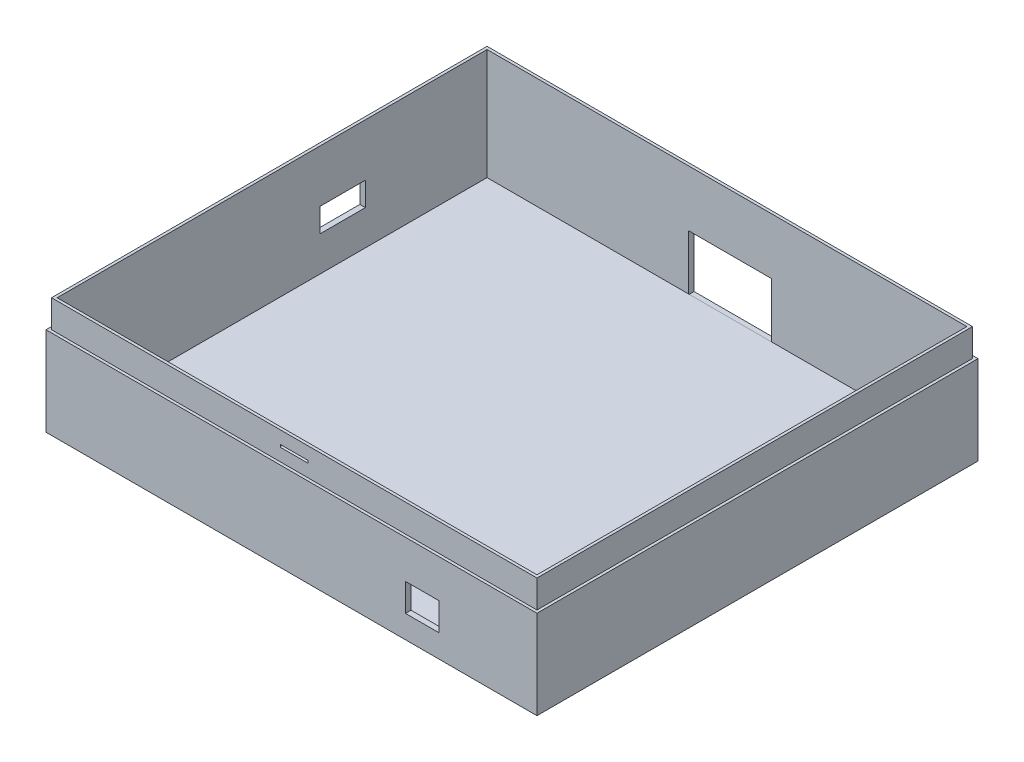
ISO-10303-21;
HEADER;
FILE_DESCRIPTION(('STEP AP214'),'2;1');
FILE_NAME('part.step','',(''),(''),'','','');
FILE_SCHEMA(('AUTOMOTIVE_DESIGN { 1 0 10303 214 1 1 1 1 }'));
ENDSEC;
DATA;
#1=APPLICATION_CONTEXT('core data for automotive mechanical design processes');
#2=APPLICATION_PROTOCOL_DEFINITION('international standard','automotive_design',2000,#1);
#3=PRODUCT_CONTEXT('',#1,'mechanical');
#4=PRODUCT('Part','Part','',(#3));
#5=PRODUCT_RELATED_PRODUCT_CATEGORY('part','',(#4));
#6=PRODUCT_DEFINITION_FORMATION('','',#4);
#7=PRODUCT_DEFINITION_CONTEXT('part definition',#1,'design');
#8=PRODUCT_DEFINITION('design','',#6,#7);
#9=PRODUCT_DEFINITION_SHAPE('','',#8);
#10=(LENGTH_UNIT() NAMED_UNIT(*) SI_UNIT(.MILLI.,.METRE.));
#11=(NAMED_UNIT(*) PLANE_ANGLE_UNIT() SI_UNIT($,.RADIAN.));
#12=(NAMED_UNIT(*) SI_UNIT($,.STERADIAN.) SOLID_ANGLE_UNIT());
#13=UNCERTAINTY_MEASURE_WITH_UNIT(LENGTH_MEASURE(1.E-05),#10,'distance_accuracy_value','');
#14=(GEOMETRIC_REPRESENTATION_CONTEXT(3) GLOBAL_UNCERTAINTY_ASSIGNED_CONTEXT((#13)) GLOBAL_UNIT_ASSIGNED_CONTEXT((#10,
#11,#12)) REPRESENTATION_CONTEXT('',''));
#15=CARTESIAN_POINT('',(0.,0.,0.));
#16=DIRECTION('',(0.,0.,1.));
#17=DIRECTION('',(1.,0.,0.));
#18=AXIS2_PLACEMENT_3D('',#15,#16,#17);
#19=CARTESIAN_POINT('',(0.,32.,0.999999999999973));
#20=DIRECTION('',(0.,0.,1.));
#21=DIRECTION('',(1.,0.,0.));
#22=AXIS2_PLACEMENT_3D('',#19,#20,#21);
#23=PLANE('',#22);
#24=DIRECTION('',(1.,0.,0.));
#25=VECTOR('',#24,1.);
#26=CARTESIAN_POINT('',(0.,42.,0.999999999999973));
#27=LINE('',#26,#25);
#28=CARTESIAN_POINT('',(-0.999999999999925,42.,0.999999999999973));
#29=VERTEX_POINT('',#28);
#30=CARTESIAN_POINT('',(174.,42.,0.999999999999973));
#31=VERTEX_POINT('',#30);
#32=EDGE_CURVE('E348',#29,#31,#27,.T.);
#33=ORIENTED_EDGE('',*,*,#32,.F.);
#34=DIRECTION('',(0.,1.,0.));
#35=VECTOR('',#34,1.);
#36=CARTESIAN_POINT('',(-0.999999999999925,32.,0.999999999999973));
#37=LINE('',#36,#35);
#38=CARTESIAN_POINT('',(-0.999999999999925,32.,0.999999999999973));
#39=VERTEX_POINT('',#38);
#40=EDGE_CURVE('E368',#39,#29,#37,.T.);
#41=ORIENTED_EDGE('',*,*,#40,.F.);
#42=DIRECTION('',(1.,0.,0.));
#43=VECTOR('',#42,1.);
#44=CARTESIAN_POINT('',(0.,32.,0.999999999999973));
#45=LINE('',#44,#43);
#46=CARTESIAN_POINT('',(174.,32.,0.999999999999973));
#47=VERTEX_POINT('',#46);
#48=EDGE_CURVE('E349',#39,#47,#45,.T.);
#49=ORIENTED_EDGE('',*,*,#48,.T.);
#50=DIRECTION('',(0.,1.,0.));
#51=VECTOR('',#50,1.);
#52=CARTESIAN_POINT('',(174.,32.,0.999999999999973));
#53=LINE('',#52,#51);
#54=EDGE_CURVE('E379',#47,#31,#53,.T.);
#55=ORIENTED_EDGE('',*,*,#54,.T.);
#56=EDGE_LOOP('',(#33,#41,#49,#55));
#57=FACE_BOUND('',#56,.T.);
#58=DIRECTION('',(1.,0.,0.));
#59=VECTOR('',#58,1.);
#60=CARTESIAN_POINT('',(81.5,36.56,1.));
#61=LINE('',#60,#59);
#62=CARTESIAN_POINT('',(81.5,36.56,1.));
#63=VERTEX_POINT('',#62);
#64=CARTESIAN_POINT('',(91.5,36.56,0.999999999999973));
#65=VERTEX_POINT('',#64);
#66=EDGE_CURVE('E322',#63,#65,#61,.T.);
#67=ORIENTED_EDGE('',*,*,#66,.F.);
#68=DIRECTION('',(0.,-1.,0.));
#69=VECTOR('',#68,1.);
#70=CARTESIAN_POINT('',(81.5,37.,1.));
#71=LINE('',#70,#69);
#72=CARTESIAN_POINT('',(81.5,37.44,1.00000000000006));
#73=VERTEX_POINT('',#72);
#74=EDGE_CURVE('E311',#73,#63,#71,.T.);
#75=ORIENTED_EDGE('',*,*,#74,.F.);
#76=DIRECTION('',(1.,0.,0.));
#77=VECTOR('',#76,1.);
#78=CARTESIAN_POINT('',(81.5,37.44,1.00000000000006));
#79=LINE('',#78,#77);
#80=CARTESIAN_POINT('',(91.5,37.44,1.00000000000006));
#81=VERTEX_POINT('',#80);
#82=EDGE_CURVE('E319',#73,#81,#79,.T.);
#83=ORIENTED_EDGE('',*,*,#82,.T.);
#84=DIRECTION('',(0.,-1.,0.));
#85=VECTOR('',#84,1.);
#86=CARTESIAN_POINT('',(91.5,37.,1.));
#87=LINE('',#86,#85);
#88=EDGE_CURVE('E302',#81,#65,#87,.T.);
#89=ORIENTED_EDGE('',*,*,#88,.T.);
#90=EDGE_LOOP('',(#67,#75,#83,#89));
#91=FACE_BOUND('',#90,.T.);
#92=ADVANCED_FACE('F43',(#57,#91),#23,.T.);
#93=CARTESIAN_POINT('',(0.,32.,-156.));
#94=DIRECTION('',(0.,0.,1.));
#95=DIRECTION('',(1.,0.,0.));
#96=AXIS2_PLACEMENT_3D('',#93,#94,#95);
#97=PLANE('',#96);
#98=DIRECTION('',(1.,0.,0.));
#99=VECTOR('',#98,1.);
#100=CARTESIAN_POINT('',(0.,42.,-156.));
#101=LINE('',#100,#99);
#102=CARTESIAN_POINT('',(-0.999999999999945,42.,-156.));
#103=VERTEX_POINT('',#102);
#104=CARTESIAN_POINT('',(174.,42.,-156.));
#105=VERTEX_POINT('',#104);
#106=EDGE_CURVE('E374',#103,#105,#101,.T.);
#107=ORIENTED_EDGE('',*,*,#106,.T.);
#108=DIRECTION('',(0.,1.,0.));
#109=VECTOR('',#108,1.);
#110=CARTESIAN_POINT('',(174.,32.,-156.));
#111=LINE('',#110,#109);
#112=CARTESIAN_POINT('',(174.,32.,-156.));
#113=VERTEX_POINT('',#112);
#114=EDGE_CURVE('E382',#113,#105,#111,.T.);
#115=ORIENTED_EDGE('',*,*,#114,.F.);
#116=DIRECTION('',(1.,0.,0.));
#117=VECTOR('',#116,1.);
#118=CARTESIAN_POINT('',(0.,32.,-156.));
#119=LINE('',#118,#117);
#120=CARTESIAN_POINT('',(-0.999999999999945,32.,-156.));
#121=VERTEX_POINT('',#120);
#122=EDGE_CURVE('E354',#121,#113,#119,.T.);
#123=ORIENTED_EDGE('',*,*,#122,.F.);
#124=DIRECTION('',(0.,1.,0.));
#125=VECTOR('',#124,1.);
#126=CARTESIAN_POINT('',(-0.999999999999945,32.,-156.));
#127=LINE('',#126,#125);
#128=EDGE_CURVE('E384',#121,#103,#127,.T.);
#129=ORIENTED_EDGE('',*,*,#128,.T.);
#130=EDGE_LOOP('',(#107,#115,#123,#129));
#131=FACE_BOUND('',#130,.T.);
#132=DIRECTION('',(0.,-1.,1.26161707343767E-13));
#133=VECTOR('',#132,1.);
#134=CARTESIAN_POINT('',(81.5,37.,-156.));
#135=LINE('',#134,#133);
#136=CARTESIAN_POINT('',(81.5,37.44,-156.));
#137=VERTEX_POINT('',#136);
#138=CARTESIAN_POINT('',(81.5,36.56,-156.));
#139=VERTEX_POINT('',#138);
#140=EDGE_CURVE('E337',#137,#139,#135,.T.);
#141=ORIENTED_EDGE('',*,*,#140,.T.);
#142=DIRECTION('',(1.,0.,0.));
#143=VECTOR('',#142,1.);
#144=CARTESIAN_POINT('',(81.5,36.56,-156.));
#145=LINE('',#144,#143);
#146=CARTESIAN_POINT('',(91.5,36.56,-156.));
#147=VERTEX_POINT('',#146);
#148=EDGE_CURVE('E340',#139,#147,#145,.T.);
#149=ORIENTED_EDGE('',*,*,#148,.T.);
#150=DIRECTION('',(0.,-1.,1.26161707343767E-13));
#151=VECTOR('',#150,1.);
#152=CARTESIAN_POINT('',(91.5,37.,-156.));
#153=LINE('',#152,#151);
#154=CARTESIAN_POINT('',(91.5,37.44,-156.));
#155=VERTEX_POINT('',#154);
#156=EDGE_CURVE('E330',#155,#147,#153,.T.);
#157=ORIENTED_EDGE('',*,*,#156,.F.);
#158=DIRECTION('',(1.,0.,0.));
#159=VECTOR('',#158,1.);
#160=CARTESIAN_POINT('',(81.5,37.44,-156.));
#161=LINE('',#160,#159);
#162=EDGE_CURVE('E343',#137,#155,#161,.T.);
#163=ORIENTED_EDGE('',*,*,#162,.F.);
#164=EDGE_LOOP('',(#141,#149,#157,#163));
#165=FACE_BOUND('',#164,.T.);
#166=ADVANCED_FACE('F514',(#131,#165),#97,.F.);
#167=CARTESIAN_POINT('',(-1.99999999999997,1.99999999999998,1.99999999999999));
#168=DIRECTION('',(-1.,0.,0.));
#169=DIRECTION('',(0.,0.,1.));
#170=AXIS2_PLACEMENT_3D('',#167,#168,#169);
#171=PLANE('',#170);
#172=DIRECTION('',(0.,0.,1.));
#173=VECTOR('',#172,1.);
#174=CARTESIAN_POINT('',(-1.99999999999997,14.5592636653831,0.));
#175=LINE('',#174,#173);
#176=CARTESIAN_POINT('',(-1.99999999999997,14.5592636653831,-111.153651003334));
#177=VERTEX_POINT('',#176);
#178=CARTESIAN_POINT('',(-1.99999999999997,14.5592636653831,-94.8536510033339));
#179=VERTEX_POINT('',#178);
#180=EDGE_CURVE('E58',#177,#179,#175,.T.);
#181=ORIENTED_EDGE('',*,*,#180,.F.);
#182=DIRECTION('',(0.,1.,0.));
#183=VECTOR('',#182,1.);
#184=CARTESIAN_POINT('',(-1.99999999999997,0.,-111.153651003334));
#185=LINE('',#184,#183);
#186=CARTESIAN_POINT('',(-1.99999999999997,23.1276174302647,-111.153651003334));
#187=VERTEX_POINT('',#186);
#188=EDGE_CURVE('E261',#177,#187,#185,.T.);
#189=ORIENTED_EDGE('',*,*,#188,.T.);
#190=DIRECTION('',(0.,0.,1.));
#191=VECTOR('',#190,1.);
#192=CARTESIAN_POINT('',(-1.99999999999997,23.1276174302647,0.));
#193=LINE('',#192,#191);
#194=CARTESIAN_POINT('',(-1.99999999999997,23.1276174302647,-94.8536510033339));
#195=VERTEX_POINT('',#194);
#196=EDGE_CURVE('E264',#187,#195,#193,.T.);
#197=ORIENTED_EDGE('',*,*,#196,.T.);
#198=DIRECTION('',(0.,1.,0.));
#199=VECTOR('',#198,1.);
#200=CARTESIAN_POINT('',(-1.99999999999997,0.,-94.8536510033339));
#201=LINE('',#200,#199);
#202=EDGE_CURVE('E270',#179,#195,#201,.T.);
#203=ORIENTED_EDGE('',*,*,#202,.F.);
#204=EDGE_LOOP('',(#181,#189,#197,#203));
#205=FACE_BOUND('',#204,.T.);
#206=DIRECTION('',(0.,-1.,0.));
#207=VECTOR('',#206,1.);
#208=CARTESIAN_POINT('',(-1.99999999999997,1.99999999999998,1.99999999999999));
#209=LINE('',#208,#207);
#210=CARTESIAN_POINT('',(-1.99999999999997,32.,1.99999999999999));
#211=VERTEX_POINT('',#210);
#212=CARTESIAN_POINT('',(-1.99999999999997,0.,1.99999999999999));
#213=VERTEX_POINT('',#212);
#214=EDGE_CURVE('E464',#211,#213,#209,.T.);
#215=ORIENTED_EDGE('',*,*,#214,.F.);
#216=DIRECTION('',(0.,0.,1.));
#217=VECTOR('',#216,1.);
#218=CARTESIAN_POINT('',(-1.99999999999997,32.,0.));
#219=LINE('',#218,#217);
#220=CARTESIAN_POINT('',(-1.99999999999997,32.,-157.));
#221=VERTEX_POINT('',#220);
#222=EDGE_CURVE('E366',#221,#211,#219,.T.);
#223=ORIENTED_EDGE('',*,*,#222,.F.);
#224=DIRECTION('',(0.,-1.,0.));
#225=VECTOR('',#224,1.);
#226=CARTESIAN_POINT('',(-1.99999999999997,1.99999999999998,-157.));
#227=LINE('',#226,#225);
#228=CARTESIAN_POINT('',(-1.99999999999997,0.,-157.));
#229=VERTEX_POINT('',#228);
#230=EDGE_CURVE('E463',#221,#229,#227,.T.);
#231=ORIENTED_EDGE('',*,*,#230,.T.);
#232=DIRECTION('',(0.,0.,-1.));
#233=VECTOR('',#232,1.);
#234=CARTESIAN_POINT('',(-1.99999999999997,0.,1.99999999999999));
#235=LINE('',#234,#233);
#236=EDGE_CURVE('E451',#213,#229,#235,.T.);
#237=ORIENTED_EDGE('',*,*,#236,.F.);
#238=EDGE_LOOP('',(#215,#223,#231,#237));
#239=FACE_BOUND('',#238,.T.);
#240=ADVANCED_FACE('F522',(#205,#239),#171,.T.);
#241=CARTESIAN_POINT('',(-1.99999999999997,1.99999999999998,1.99999999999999));
#242=DIRECTION('',(0.,0.,1.));
#243=DIRECTION('',(1.,0.,0.));
#244=AXIS2_PLACEMENT_3D('',#241,#242,#243);
#245=PLANE('',#244);
#246=DIRECTION('',(1.,0.,0.));
#247=VECTOR('',#246,1.);
#248=CARTESIAN_POINT('',(0.,8.2402439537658,1.99999999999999));
#249=LINE('',#248,#247);
#250=CARTESIAN_POINT('',(127.606016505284,8.2402439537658,1.99999999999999));
#251=VERTEX_POINT('',#250);
#252=CARTESIAN_POINT('',(139.606016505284,8.2402439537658,1.99999999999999));
#253=VERTEX_POINT('',#252);
#254=EDGE_CURVE('E276',#251,#253,#249,.T.);
#255=ORIENTED_EDGE('',*,*,#254,.F.);
#256=DIRECTION('',(0.,1.,0.));
#257=VECTOR('',#256,1.);
#258=CARTESIAN_POINT('',(127.606016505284,0.,1.99999999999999));
#259=LINE('',#258,#257);
#260=CARTESIAN_POINT('',(127.606016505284,18.2402439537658,1.99999999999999));
#261=VERTEX_POINT('',#260);
#262=EDGE_CURVE('E287',#251,#261,#259,.T.);
#263=ORIENTED_EDGE('',*,*,#262,.T.);
#264=DIRECTION('',(1.,0.,0.));
#265=VECTOR('',#264,1.);
#266=CARTESIAN_POINT('',(0.,18.2402439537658,1.99999999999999));
#267=LINE('',#266,#265);
#268=CARTESIAN_POINT('',(139.606016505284,18.2402439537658,1.99999999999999));
#269=VERTEX_POINT('',#268);
#270=EDGE_CURVE('E284',#261,#269,#267,.T.);
#271=ORIENTED_EDGE('',*,*,#270,.T.);
#272=DIRECTION('',(0.,1.,0.));
#273=VECTOR('',#272,1.);
#274=CARTESIAN_POINT('',(139.606016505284,0.,1.99999999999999));
#275=LINE('',#274,#273);
#276=EDGE_CURVE('E281',#253,#269,#275,.T.);
#277=ORIENTED_EDGE('',*,*,#276,.F.);
#278=EDGE_LOOP('',(#255,#263,#271,#277));
#279=FACE_BOUND('',#278,.T.);
#280=DIRECTION('',(0.,-1.,0.));
#281=VECTOR('',#280,1.);
#282=CARTESIAN_POINT('',(175.,1.99999999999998,1.99999999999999));
#283=LINE('',#282,#281);
#284=CARTESIAN_POINT('',(175.,32.,1.99999999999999));
#285=VERTEX_POINT('',#284);
#286=CARTESIAN_POINT('',(175.,0.,1.99999999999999));
#287=VERTEX_POINT('',#286);
#288=EDGE_CURVE('E467',#285,#287,#283,.T.);
#289=ORIENTED_EDGE('',*,*,#288,.F.);
#290=DIRECTION('',(1.,0.,0.));
#291=VECTOR('',#290,1.);
#292=CARTESIAN_POINT('',(0.,32.,1.99999999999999));
#293=LINE('',#292,#291);
#294=EDGE_CURVE('E360',#211,#285,#293,.T.);
#295=ORIENTED_EDGE('',*,*,#294,.F.);
#296=ORIENTED_EDGE('',*,*,#214,.T.);
#297=DIRECTION('',(-1.,0.,0.));
#298=VECTOR('',#297,1.);
#299=CARTESIAN_POINT('',(-1.99999999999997,0.,1.99999999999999));
#300=LINE('',#299,#298);
#301=EDGE_CURVE('E460',#287,#213,#300,.T.);
#302=ORIENTED_EDGE('',*,*,#301,.F.);
#303=EDGE_LOOP('',(#289,#295,#296,#302));
#304=FACE_BOUND('',#303,.T.);
#305=ADVANCED_FACE('F495',(#279,#304),#245,.T.);
#306=CARTESIAN_POINT('',(175.,1.99999999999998,1.99999999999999));
#307=DIRECTION('',(1.,0.,0.));
#308=DIRECTION('',(0.,0.,-1.));
#309=AXIS2_PLACEMENT_3D('',#306,#307,#308);
#310=PLANE('',#309);
#311=DIRECTION('',(0.,-1.,0.));
#312=VECTOR('',#311,1.);
#313=CARTESIAN_POINT('',(175.,1.99999999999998,-157.));
#314=LINE('',#313,#312);
#315=CARTESIAN_POINT('',(175.,32.,-157.));
#316=VERTEX_POINT('',#315);
#317=CARTESIAN_POINT('',(175.,0.,-157.));
#318=VERTEX_POINT('',#317);
#319=EDGE_CURVE('E469',#316,#318,#314,.T.);
#320=ORIENTED_EDGE('',*,*,#319,.F.);
#321=DIRECTION('',(0.,0.,-1.));
#322=VECTOR('',#321,1.);
#323=CARTESIAN_POINT('',(175.,32.,0.));
#324=LINE('',#323,#322);
#325=EDGE_CURVE('E362',#285,#316,#324,.T.);
#326=ORIENTED_EDGE('',*,*,#325,.F.);
#327=ORIENTED_EDGE('',*,*,#288,.T.);
#328=DIRECTION('',(0.,0.,1.));
#329=VECTOR('',#328,1.);
#330=CARTESIAN_POINT('',(175.,0.,1.99999999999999));
#331=LINE('',#330,#329);
#332=EDGE_CURVE('E457',#318,#287,#331,.T.);
#333=ORIENTED_EDGE('',*,*,#332,.F.);
#334=EDGE_LOOP('',(#320,#326,#327,#333));
#335=FACE_BOUND('',#334,.T.);
#336=ADVANCED_FACE('F570',(#335),#310,.T.);
#337=CARTESIAN_POINT('',(-1.99999999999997,1.99999999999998,-157.));
#338=DIRECTION('',(0.,0.,-1.));
#339=DIRECTION('',(-1.,0.,0.));
#340=AXIS2_PLACEMENT_3D('',#337,#338,#339);
#341=PLANE('',#340);
#342=DIRECTION('',(0.,1.,0.));
#343=VECTOR('',#342,1.);
#344=CARTESIAN_POINT('',(72.6351643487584,1.99999999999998,-157.));
#345=LINE('',#344,#343);
#346=CARTESIAN_POINT('',(72.6351643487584,1.75540363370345,-157.));
#347=VERTEX_POINT('',#346);
#348=CARTESIAN_POINT('',(72.6351643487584,21.7554036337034,-157.));
#349=VERTEX_POINT('',#348);
#350=EDGE_CURVE('E413',#347,#349,#345,.T.);
#351=ORIENTED_EDGE('',*,*,#350,.F.);
#352=DIRECTION('',(-1.,0.,0.));
#353=VECTOR('',#352,1.);
#354=CARTESIAN_POINT('',(-1.99999999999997,1.75540363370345,-157.));
#355=LINE('',#354,#353);
#356=CARTESIAN_POINT('',(102.635164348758,1.75540363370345,-157.));
#357=VERTEX_POINT('',#356);
#358=EDGE_CURVE('E466',#357,#347,#355,.T.);
#359=ORIENTED_EDGE('',*,*,#358,.F.);
#360=DIRECTION('',(0.,-1.,0.));
#361=VECTOR('',#360,1.);
#362=CARTESIAN_POINT('',(102.635164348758,1.99999999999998,-157.));
#363=LINE('',#362,#361);
#364=CARTESIAN_POINT('',(102.635164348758,21.7554036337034,-157.));
#365=VERTEX_POINT('',#364);
#366=EDGE_CURVE('E403',#365,#357,#363,.T.);
#367=ORIENTED_EDGE('',*,*,#366,.F.);
#368=DIRECTION('',(1.,0.,0.));
#369=VECTOR('',#368,1.);
#370=CARTESIAN_POINT('',(-1.99999999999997,21.7554036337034,-157.));
#371=LINE('',#370,#369);
#372=EDGE_CURVE('E411',#349,#365,#371,.T.);
#373=ORIENTED_EDGE('',*,*,#372,.F.);
#374=EDGE_LOOP('',(#351,#359,#367,#373));
#375=FACE_BOUND('',#374,.T.);
#376=ORIENTED_EDGE('',*,*,#230,.F.);
#377=DIRECTION('',(-1.,0.,0.));
#378=VECTOR('',#377,1.);
#379=CARTESIAN_POINT('',(0.,32.,-157.));
#380=LINE('',#379,#378);
#381=EDGE_CURVE('E364',#316,#221,#380,.T.);
#382=ORIENTED_EDGE('',*,*,#381,.F.);
#383=ORIENTED_EDGE('',*,*,#319,.T.);
#384=DIRECTION('',(1.,0.,0.));
#385=VECTOR('',#384,1.);
#386=CARTESIAN_POINT('',(-1.99999999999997,0.,-157.));
#387=LINE('',#386,#385);
#388=EDGE_CURVE('E454',#229,#318,#387,.T.);
#389=ORIENTED_EDGE('',*,*,#388,.F.);
#390=EDGE_LOOP('',(#376,#382,#383,#389));
#391=FACE_BOUND('',#390,.T.);
#392=ADVANCED_FACE('F554',(#375,#391),#341,.T.);
#393=CARTESIAN_POINT('',(0.,42.,0.));
#394=DIRECTION('',(0.,1.,0.));
#395=DIRECTION('',(0.,0.,1.));
#396=AXIS2_PLACEMENT_3D('',#393,#394,#395);
#397=PLANE('',#396);
#398=DIRECTION('',(0.,0.,1.));
#399=VECTOR('',#398,1.);
#400=CARTESIAN_POINT('',(0.,42.,0.));
#401=LINE('',#400,#399);
#402=CARTESIAN_POINT('',(0.,42.,-155.));
#403=VERTEX_POINT('',#402);
#404=CARTESIAN_POINT('',(0.,42.,0.));
#405=VERTEX_POINT('',#404);
#406=EDGE_CURVE('E416',#403,#405,#401,.T.);
#407=ORIENTED_EDGE('',*,*,#406,.F.);
#408=DIRECTION('',(-1.,0.,0.));
#409=VECTOR('',#408,1.);
#410=CARTESIAN_POINT('',(0.,42.,-155.));
#411=LINE('',#410,#409);
#412=CARTESIAN_POINT('',(173.,42.,-155.));
#413=VERTEX_POINT('',#412);
#414=EDGE_CURVE('E419',#413,#403,#411,.T.);
#415=ORIENTED_EDGE('',*,*,#414,.F.);
#416=DIRECTION('',(0.,0.,-1.));
#417=VECTOR('',#416,1.);
#418=CARTESIAN_POINT('',(173.,42.,0.));
#419=LINE('',#418,#417);
#420=CARTESIAN_POINT('',(173.,42.,0.));
#421=VERTEX_POINT('',#420);
#422=EDGE_CURVE('E423',#421,#413,#419,.T.);
#423=ORIENTED_EDGE('',*,*,#422,.F.);
#424=DIRECTION('',(1.,0.,0.));
#425=VECTOR('',#424,1.);
#426=CARTESIAN_POINT('',(0.,42.,0.));
#427=LINE('',#426,#425);
#428=EDGE_CURVE('E426',#405,#421,#427,.T.);
#429=ORIENTED_EDGE('',*,*,#428,.F.);
#430=EDGE_LOOP('',(#407,#415,#423,#429));
#431=FACE_BOUND('',#430,.T.);
#432=DIRECTION('',(0.,0.,1.));
#433=VECTOR('',#432,1.);
#434=CARTESIAN_POINT('',(-0.999999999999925,42.,0.));
#435=LINE('',#434,#433);
#436=EDGE_CURVE('E371',#103,#29,#435,.T.);
#437=ORIENTED_EDGE('',*,*,#436,.T.);
#438=ORIENTED_EDGE('',*,*,#32,.T.);
#439=DIRECTION('',(0.,0.,1.));
#440=VECTOR('',#439,1.);
#441=CARTESIAN_POINT('',(174.,42.,0.));
#442=LINE('',#441,#440);
#443=EDGE_CURVE('E352',#105,#31,#442,.T.);
#444=ORIENTED_EDGE('',*,*,#443,.F.);
#445=ORIENTED_EDGE('',*,*,#106,.F.);
#446=EDGE_LOOP('',(#437,#438,#444,#445));
#447=FACE_BOUND('',#446,.T.);
#448=ADVANCED_FACE('F551',(#431,#447),#397,.T.);
#449=CARTESIAN_POINT('',(0.,0.,0.));
#450=DIRECTION('',(0.,-1.,0.));
#451=DIRECTION('',(0.,0.,-1.));
#452=AXIS2_PLACEMENT_3D('',#449,#450,#451);
#453=PLANE('',#452);
#454=ORIENTED_EDGE('',*,*,#236,.T.);
#455=ORIENTED_EDGE('',*,*,#388,.T.);
#456=ORIENTED_EDGE('',*,*,#332,.T.);
#457=ORIENTED_EDGE('',*,*,#301,.T.);
#458=EDGE_LOOP('',(#454,#455,#456,#457));
#459=FACE_BOUND('',#458,.T.);
#460=ADVANCED_FACE('F45',(#459),#453,.T.);
#461=CARTESIAN_POINT('',(0.,42.,0.));
#462=DIRECTION('',(1.,0.,0.));
#463=DIRECTION('',(0.,0.,-1.));
#464=AXIS2_PLACEMENT_3D('',#461,#462,#463);
#465=PLANE('',#464);
#466=DIRECTION('',(0.,0.,1.));
#467=VECTOR('',#466,1.);
#468=CARTESIAN_POINT('',(0.,14.5592636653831,0.));
#469=LINE('',#468,#467);
#470=CARTESIAN_POINT('',(0.,14.5592636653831,-111.153651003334));
#471=VERTEX_POINT('',#470);
#472=CARTESIAN_POINT('',(0.,14.5592636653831,-94.8536510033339));
#473=VERTEX_POINT('',#472);
#474=EDGE_CURVE('E247',#471,#473,#469,.T.);
#475=ORIENTED_EDGE('',*,*,#474,.T.);
#476=DIRECTION('',(0.,1.,0.));
#477=VECTOR('',#476,1.);
#478=CARTESIAN_POINT('',(0.,0.,-94.8536510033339));
#479=LINE('',#478,#477);
#480=CARTESIAN_POINT('',(0.,23.1276174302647,-94.8536510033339));
#481=VERTEX_POINT('',#480);
#482=EDGE_CURVE('E253',#473,#481,#479,.T.);
#483=ORIENTED_EDGE('',*,*,#482,.T.);
#484=DIRECTION('',(0.,0.,1.));
#485=VECTOR('',#484,1.);
#486=CARTESIAN_POINT('',(0.,23.1276174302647,0.));
#487=LINE('',#486,#485);
#488=CARTESIAN_POINT('',(0.,23.1276174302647,-111.153651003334));
#489=VERTEX_POINT('',#488);
#490=EDGE_CURVE('E257',#489,#481,#487,.T.);
#491=ORIENTED_EDGE('',*,*,#490,.F.);
#492=DIRECTION('',(0.,1.,0.));
#493=VECTOR('',#492,1.);
#494=CARTESIAN_POINT('',(0.,0.,-111.153651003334));
#495=LINE('',#494,#493);
#496=EDGE_CURVE('E250',#471,#489,#495,.T.);
#497=ORIENTED_EDGE('',*,*,#496,.F.);
#498=EDGE_LOOP('',(#475,#483,#491,#497));
#499=FACE_BOUND('',#498,.T.);
#500=DIRECTION('',(0.,0.,1.));
#501=VECTOR('',#500,1.);
#502=CARTESIAN_POINT('',(0.,2.,0.));
#503=LINE('',#502,#501);
#504=CARTESIAN_POINT('',(0.,2.,-155.));
#505=VERTEX_POINT('',#504);
#506=CARTESIAN_POINT('',(0.,2.,0.));
#507=VERTEX_POINT('',#506);
#508=EDGE_CURVE('E415',#505,#507,#503,.T.);
#509=ORIENTED_EDGE('',*,*,#508,.F.);
#510=DIRECTION('',(0.,-1.,0.));
#511=VECTOR('',#510,1.);
#512=CARTESIAN_POINT('',(0.,42.,-155.));
#513=LINE('',#512,#511);
#514=EDGE_CURVE('E448',#403,#505,#513,.T.);
#515=ORIENTED_EDGE('',*,*,#514,.F.);
#516=ORIENTED_EDGE('',*,*,#406,.T.);
#517=DIRECTION('',(0.,-1.,0.));
#518=VECTOR('',#517,1.);
#519=CARTESIAN_POINT('',(0.,42.,0.));
#520=LINE('',#519,#518);
#521=EDGE_CURVE('E429',#405,#507,#520,.T.);
#522=ORIENTED_EDGE('',*,*,#521,.T.);
#523=EDGE_LOOP('',(#509,#515,#516,#522));
#524=FACE_BOUND('',#523,.T.);
#525=ADVANCED_FACE('F259',(#499,#524),#465,.T.);
#526=CARTESIAN_POINT('',(0.,42.,-155.));
#527=DIRECTION('',(0.,0.,1.));
#528=DIRECTION('',(1.,0.,0.));
#529=AXIS2_PLACEMENT_3D('',#526,#527,#528);
#530=PLANE('',#529);
#531=DIRECTION('',(0.,-1.,0.));
#532=VECTOR('',#531,1.);
#533=CARTESIAN_POINT('',(72.6351643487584,21.7554036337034,-155.));
#534=LINE('',#533,#532);
#535=CARTESIAN_POINT('',(72.6351643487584,21.7554036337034,-155.));
#536=VERTEX_POINT('',#535);
#537=CARTESIAN_POINT('',(72.6351643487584,2.,-155.));
#538=VERTEX_POINT('',#537);
#539=EDGE_CURVE('E388',#536,#538,#534,.T.);
#540=ORIENTED_EDGE('',*,*,#539,.F.);
#541=DIRECTION('',(-1.,0.,0.));
#542=VECTOR('',#541,1.);
#543=CARTESIAN_POINT('',(72.6351643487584,21.7554036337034,-155.));
#544=LINE('',#543,#542);
#545=CARTESIAN_POINT('',(102.635164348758,21.7554036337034,-155.));
#546=VERTEX_POINT('',#545);
#547=EDGE_CURVE('E397',#546,#536,#544,.T.);
#548=ORIENTED_EDGE('',*,*,#547,.F.);
#549=DIRECTION('',(0.,1.,0.));
#550=VECTOR('',#549,1.);
#551=CARTESIAN_POINT('',(102.635164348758,21.7554036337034,-155.));
#552=LINE('',#551,#550);
#553=CARTESIAN_POINT('',(102.635164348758,2.,-155.));
#554=VERTEX_POINT('',#553);
#555=EDGE_CURVE('E393',#554,#546,#552,.T.);
#556=ORIENTED_EDGE('',*,*,#555,.F.);
#557=DIRECTION('',(-1.,0.,0.));
#558=VECTOR('',#557,1.);
#559=CARTESIAN_POINT('',(0.,2.,-155.));
#560=LINE('',#559,#558);
#561=CARTESIAN_POINT('',(173.,2.,-155.));
#562=VERTEX_POINT('',#561);
#563=EDGE_CURVE('E433',#562,#554,#560,.T.);
#564=ORIENTED_EDGE('',*,*,#563,.F.);
#565=DIRECTION('',(0.,-1.,0.));
#566=VECTOR('',#565,1.);
#567=CARTESIAN_POINT('',(173.,42.,-155.));
#568=LINE('',#567,#566);
#569=EDGE_CURVE('E446',#413,#562,#568,.T.);
#570=ORIENTED_EDGE('',*,*,#569,.F.);
#571=ORIENTED_EDGE('',*,*,#414,.T.);
#572=ORIENTED_EDGE('',*,*,#514,.T.);
#573=EDGE_CURVE('E432',#538,#505,#560,.T.);
#574=ORIENTED_EDGE('',*,*,#573,.F.);
#575=EDGE_LOOP('',(#540,#548,#556,#564,#570,#571,#572,#574));
#576=FACE_BOUND('',#575,.T.);
#577=ADVANCED_FACE('F561',(#576),#530,.T.);
#578=CARTESIAN_POINT('',(173.,42.,0.));
#579=DIRECTION('',(-1.,0.,0.));
#580=DIRECTION('',(0.,0.,1.));
#581=AXIS2_PLACEMENT_3D('',#578,#579,#580);
#582=PLANE('',#581);
#583=DIRECTION('',(0.,0.,-1.));
#584=VECTOR('',#583,1.);
#585=CARTESIAN_POINT('',(173.,2.,0.));
#586=LINE('',#585,#584);
#587=CARTESIAN_POINT('',(173.,2.,0.));
#588=VERTEX_POINT('',#587);
#589=EDGE_CURVE('E436',#588,#562,#586,.T.);
#590=ORIENTED_EDGE('',*,*,#589,.F.);
#591=DIRECTION('',(0.,-1.,0.));
#592=VECTOR('',#591,1.);
#593=CARTESIAN_POINT('',(173.,42.,0.));
#594=LINE('',#593,#592);
#595=EDGE_CURVE('E443',#421,#588,#594,.T.);
#596=ORIENTED_EDGE('',*,*,#595,.F.);
#597=ORIENTED_EDGE('',*,*,#422,.T.);
#598=ORIENTED_EDGE('',*,*,#569,.T.);
#599=EDGE_LOOP('',(#590,#596,#597,#598));
#600=FACE_BOUND('',#599,.T.);
#601=ADVANCED_FACE('F558',(#600),#582,.T.);
#602=CARTESIAN_POINT('',(0.,42.,0.));
#603=DIRECTION('',(0.,0.,-1.));
#604=DIRECTION('',(-1.,0.,0.));
#605=AXIS2_PLACEMENT_3D('',#602,#603,#604);
#606=PLANE('',#605);
#607=DIRECTION('',(-1.,0.,0.));
#608=VECTOR('',#607,1.);
#609=CARTESIAN_POINT('',(0.,8.2402439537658,0.));
#610=LINE('',#609,#608);
#611=CARTESIAN_POINT('',(139.606016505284,8.2402439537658,0.));
#612=VERTEX_POINT('',#611);
#613=CARTESIAN_POINT('',(127.606016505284,8.2402439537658,0.));
#614=VERTEX_POINT('',#613);
#615=EDGE_CURVE('E11',#612,#614,#610,.T.);
#616=ORIENTED_EDGE('',*,*,#615,.F.);
#617=DIRECTION('',(0.,-1.,0.));
#618=VECTOR('',#617,1.);
#619=CARTESIAN_POINT('',(139.606016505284,42.,0.));
#620=LINE('',#619,#618);
#621=CARTESIAN_POINT('',(139.606016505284,18.2402439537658,0.));
#622=VERTEX_POINT('',#621);
#623=EDGE_CURVE('E473',#622,#612,#620,.T.);
#624=ORIENTED_EDGE('',*,*,#623,.F.);
#625=DIRECTION('',(-1.,0.,0.));
#626=VECTOR('',#625,1.);
#627=CARTESIAN_POINT('',(0.,18.2402439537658,0.));
#628=LINE('',#627,#626);
#629=CARTESIAN_POINT('',(127.606016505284,18.2402439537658,0.));
#630=VERTEX_POINT('',#629);
#631=EDGE_CURVE('E475',#622,#630,#628,.T.);
#632=ORIENTED_EDGE('',*,*,#631,.T.);
#633=DIRECTION('',(0.,-1.,0.));
#634=VECTOR('',#633,1.);
#635=CARTESIAN_POINT('',(127.606016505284,42.,0.));
#636=LINE('',#635,#634);
#637=EDGE_CURVE('E51',#630,#614,#636,.T.);
#638=ORIENTED_EDGE('',*,*,#637,.T.);
#639=EDGE_LOOP('',(#616,#624,#632,#638));
#640=FACE_BOUND('',#639,.T.);
#641=DIRECTION('',(1.,0.,0.));
#642=VECTOR('',#641,1.);
#643=CARTESIAN_POINT('',(0.,2.,0.));
#644=LINE('',#643,#642);
#645=EDGE_CURVE('E420',#507,#588,#644,.T.);
#646=ORIENTED_EDGE('',*,*,#645,.F.);
#647=ORIENTED_EDGE('',*,*,#521,.F.);
#648=ORIENTED_EDGE('',*,*,#428,.T.);
#649=ORIENTED_EDGE('',*,*,#595,.T.);
#650=EDGE_LOOP('',(#646,#647,#648,#649));
#651=FACE_BOUND('',#650,.T.);
#652=ADVANCED_FACE('F480',(#640,#651),#606,.T.);
#653=CARTESIAN_POINT('',(0.,2.,0.));
#654=DIRECTION('',(0.,-1.,0.));
#655=DIRECTION('',(0.,0.,-1.));
#656=AXIS2_PLACEMENT_3D('',#653,#654,#655);
#657=PLANE('',#656);
#658=ORIENTED_EDGE('',*,*,#563,.T.);
#659=EDGE_CURVE('E437',#554,#538,#560,.T.);
#660=ORIENTED_EDGE('',*,*,#659,.T.);
#661=ORIENTED_EDGE('',*,*,#573,.T.);
#662=ORIENTED_EDGE('',*,*,#508,.T.);
#663=ORIENTED_EDGE('',*,*,#645,.T.);
#664=ORIENTED_EDGE('',*,*,#589,.T.);
#665=EDGE_LOOP('',(#658,#660,#661,#662,#663,#664));
#666=FACE_BOUND('',#665,.T.);
#667=ADVANCED_FACE('F533',(#666),#657,.F.);
#668=CARTESIAN_POINT('',(0.,0.,-155.));
#669=DIRECTION('',(0.,0.,1.));
#670=DIRECTION('',(1.,0.,0.));
#671=AXIS2_PLACEMENT_3D('',#668,#669,#670);
#672=PLANE('',#671);
#673=CARTESIAN_POINT('',(102.635164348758,1.75540363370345,-155.));
#674=VERTEX_POINT('',#673);
#675=EDGE_CURVE('E394',#674,#554,#552,.T.);
#676=ORIENTED_EDGE('',*,*,#675,.F.);
#677=DIRECTION('',(1.,0.,0.));
#678=VECTOR('',#677,1.);
#679=CARTESIAN_POINT('',(72.6351643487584,1.75540363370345,-155.));
#680=LINE('',#679,#678);
#681=CARTESIAN_POINT('',(72.6351643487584,1.75540363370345,-155.));
#682=VERTEX_POINT('',#681);
#683=EDGE_CURVE('E390',#682,#674,#680,.T.);
#684=ORIENTED_EDGE('',*,*,#683,.F.);
#685=EDGE_CURVE('E381',#538,#682,#534,.T.);
#686=ORIENTED_EDGE('',*,*,#685,.F.);
#687=ORIENTED_EDGE('',*,*,#659,.F.);
#688=EDGE_LOOP('',(#676,#684,#686,#687));
#689=FACE_BOUND('',#688,.T.);
#690=ADVANCED_FACE('F529',(#689),#672,.F.);
#691=CARTESIAN_POINT('',(72.6351643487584,21.7554036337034,-176.));
#692=DIRECTION('',(-1.,0.,0.));
#693=DIRECTION('',(0.,0.,1.));
#694=AXIS2_PLACEMENT_3D('',#691,#692,#693);
#695=PLANE('',#694);
#696=ORIENTED_EDGE('',*,*,#350,.T.);
#697=DIRECTION('',(0.,0.,1.));
#698=VECTOR('',#697,1.);
#699=CARTESIAN_POINT('',(72.6351643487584,21.7554036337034,-176.));
#700=LINE('',#699,#698);
#701=EDGE_CURVE('E401',#349,#536,#700,.T.);
#702=ORIENTED_EDGE('',*,*,#701,.T.);
#703=ORIENTED_EDGE('',*,*,#539,.T.);
#704=ORIENTED_EDGE('',*,*,#685,.T.);
#705=DIRECTION('',(0.,0.,1.));
#706=VECTOR('',#705,1.);
#707=CARTESIAN_POINT('',(72.6351643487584,1.75540363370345,-176.));
#708=LINE('',#707,#706);
#709=EDGE_CURVE('E400',#347,#682,#708,.T.);
#710=ORIENTED_EDGE('',*,*,#709,.F.);
#711=EDGE_LOOP('',(#696,#702,#703,#704,#710));
#712=FACE_BOUND('',#711,.T.);
#713=ADVANCED_FACE('F532',(#712),#695,.F.);
#714=CARTESIAN_POINT('',(72.6351643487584,21.7554036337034,-176.));
#715=DIRECTION('',(0.,1.,0.));
#716=DIRECTION('',(0.,0.,1.));
#717=AXIS2_PLACEMENT_3D('',#714,#715,#716);
#718=PLANE('',#717);
#719=ORIENTED_EDGE('',*,*,#372,.T.);
#720=DIRECTION('',(0.,0.,1.));
#721=VECTOR('',#720,1.);
#722=CARTESIAN_POINT('',(102.635164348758,21.7554036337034,-176.));
#723=LINE('',#722,#721);
#724=EDGE_CURVE('E404',#365,#546,#723,.T.);
#725=ORIENTED_EDGE('',*,*,#724,.T.);
#726=ORIENTED_EDGE('',*,*,#547,.T.);
#727=ORIENTED_EDGE('',*,*,#701,.F.);
#728=EDGE_LOOP('',(#719,#725,#726,#727));
#729=FACE_BOUND('',#728,.T.);
#730=ADVANCED_FACE('F535',(#729),#718,.F.);
#731=CARTESIAN_POINT('',(102.635164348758,21.7554036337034,-176.));
#732=DIRECTION('',(1.,0.,0.));
#733=DIRECTION('',(0.,0.,-1.));
#734=AXIS2_PLACEMENT_3D('',#731,#732,#733);
#735=PLANE('',#734);
#736=ORIENTED_EDGE('',*,*,#366,.T.);
#737=DIRECTION('',(0.,0.,1.));
#738=VECTOR('',#737,1.);
#739=CARTESIAN_POINT('',(102.635164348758,1.75540363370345,-176.));
#740=LINE('',#739,#738);
#741=EDGE_CURVE('E406',#357,#674,#740,.T.);
#742=ORIENTED_EDGE('',*,*,#741,.T.);
#743=ORIENTED_EDGE('',*,*,#675,.T.);
#744=ORIENTED_EDGE('',*,*,#555,.T.);
#745=ORIENTED_EDGE('',*,*,#724,.F.);
#746=EDGE_LOOP('',(#736,#742,#743,#744,#745));
#747=FACE_BOUND('',#746,.T.);
#748=ADVANCED_FACE('F538',(#747),#735,.F.);
#749=CARTESIAN_POINT('',(72.6351643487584,1.75540363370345,-176.));
#750=DIRECTION('',(0.,-1.,0.));
#751=DIRECTION('',(0.,0.,-1.));
#752=AXIS2_PLACEMENT_3D('',#749,#750,#751);
#753=PLANE('',#752);
#754=ORIENTED_EDGE('',*,*,#358,.T.);
#755=ORIENTED_EDGE('',*,*,#709,.T.);
#756=ORIENTED_EDGE('',*,*,#683,.T.);
#757=ORIENTED_EDGE('',*,*,#741,.F.);
#758=EDGE_LOOP('',(#754,#755,#756,#757));
#759=FACE_BOUND('',#758,.T.);
#760=ADVANCED_FACE('F542',(#759),#753,.F.);
#761=CARTESIAN_POINT('',(174.,32.,0.));
#762=DIRECTION('',(-1.,0.,0.));
#763=DIRECTION('',(0.,0.,1.));
#764=AXIS2_PLACEMENT_3D('',#761,#762,#763);
#765=PLANE('',#764);
#766=ORIENTED_EDGE('',*,*,#443,.T.);
#767=ORIENTED_EDGE('',*,*,#54,.F.);
#768=DIRECTION('',(0.,0.,1.));
#769=VECTOR('',#768,1.);
#770=CARTESIAN_POINT('',(174.,32.,0.));
#771=LINE('',#770,#769);
#772=EDGE_CURVE('E357',#113,#47,#771,.T.);
#773=ORIENTED_EDGE('',*,*,#772,.F.);
#774=ORIENTED_EDGE('',*,*,#114,.T.);
#775=EDGE_LOOP('',(#766,#767,#773,#774));
#776=FACE_BOUND('',#775,.T.);
#777=ADVANCED_FACE('F546',(#776),#765,.F.);
#778=CARTESIAN_POINT('',(-0.999999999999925,32.,0.));
#779=DIRECTION('',(-1.,0.,0.));
#780=DIRECTION('',(0.,0.,1.));
#781=AXIS2_PLACEMENT_3D('',#778,#779,#780);
#782=PLANE('',#781);
#783=ORIENTED_EDGE('',*,*,#436,.F.);
#784=ORIENTED_EDGE('',*,*,#128,.F.);
#785=DIRECTION('',(0.,0.,1.));
#786=VECTOR('',#785,1.);
#787=CARTESIAN_POINT('',(-0.999999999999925,32.,0.));
#788=LINE('',#787,#786);
#789=EDGE_CURVE('E351',#121,#39,#788,.T.);
#790=ORIENTED_EDGE('',*,*,#789,.T.);
#791=ORIENTED_EDGE('',*,*,#40,.T.);
#792=EDGE_LOOP('',(#783,#784,#790,#791));
#793=FACE_BOUND('',#792,.T.);
#794=ADVANCED_FACE('F528',(#793),#782,.T.);
#795=CARTESIAN_POINT('',(0.,32.,0.));
#796=DIRECTION('',(0.,1.,0.));
#797=DIRECTION('',(0.,0.,1.));
#798=AXIS2_PLACEMENT_3D('',#795,#796,#797);
#799=PLANE('',#798);
#800=ORIENTED_EDGE('',*,*,#48,.F.);
#801=ORIENTED_EDGE('',*,*,#789,.F.);
#802=ORIENTED_EDGE('',*,*,#122,.T.);
#803=ORIENTED_EDGE('',*,*,#772,.T.);
#804=EDGE_LOOP('',(#800,#801,#802,#803));
#805=FACE_BOUND('',#804,.T.);
#806=ORIENTED_EDGE('',*,*,#294,.T.);
#807=ORIENTED_EDGE('',*,*,#325,.T.);
#808=ORIENTED_EDGE('',*,*,#381,.T.);
#809=ORIENTED_EDGE('',*,*,#222,.T.);
#810=EDGE_LOOP('',(#806,#807,#808,#809));
#811=FACE_BOUND('',#810,.T.);
#812=ADVANCED_FACE('F614',(#805,#811),#799,.T.);
#813=CARTESIAN_POINT('',(81.5,36.56,-156.));
#814=DIRECTION('',(0.,0.707106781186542,-0.707106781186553));
#815=DIRECTION('',(0.,0.707106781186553,0.707106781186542));
#816=AXIS2_PLACEMENT_3D('',#813,#814,#815);
#817=PLANE('',#816);
#818=ORIENTED_EDGE('',*,*,#148,.F.);
#819=DIRECTION('',(0.,0.707106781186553,0.707106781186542));
#820=VECTOR('',#819,1.);
#821=CARTESIAN_POINT('',(81.5,36.56,-156.));
#822=LINE('',#821,#820);
#823=CARTESIAN_POINT('',(81.5,37.,-155.56));
#824=VERTEX_POINT('',#823);
#825=EDGE_CURVE('E332',#139,#824,#822,.T.);
#826=ORIENTED_EDGE('',*,*,#825,.T.);
#827=DIRECTION('',(1.,0.,0.));
#828=VECTOR('',#827,1.);
#829=CARTESIAN_POINT('',(81.5,37.,-155.56));
#830=LINE('',#829,#828);
#831=CARTESIAN_POINT('',(91.5,37.,-155.56));
#832=VERTEX_POINT('',#831);
#833=EDGE_CURVE('E346',#824,#832,#830,.T.);
#834=ORIENTED_EDGE('',*,*,#833,.T.);
#835=DIRECTION('',(0.,0.707106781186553,0.707106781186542));
#836=VECTOR('',#835,1.);
#837=CARTESIAN_POINT('',(91.5,36.56,-156.));
#838=LINE('',#837,#836);
#839=EDGE_CURVE('E325',#147,#832,#838,.T.);
#840=ORIENTED_EDGE('',*,*,#839,.F.);
#841=EDGE_LOOP('',(#818,#826,#834,#840));
#842=FACE_BOUND('',#841,.T.);
#843=ADVANCED_FACE('F628',(#842),#817,.T.);
#844=CARTESIAN_POINT('',(81.5,37.44,-156.));
#845=DIRECTION('',(0.,-0.707106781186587,-0.707106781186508));
#846=DIRECTION('',(0.,0.707106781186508,-0.707106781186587));
#847=AXIS2_PLACEMENT_3D('',#844,#845,#846);
#848=PLANE('',#847);
#849=ORIENTED_EDGE('',*,*,#833,.F.);
#850=DIRECTION('',(0.,0.707106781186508,-0.707106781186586));
#851=VECTOR('',#850,1.);
#852=CARTESIAN_POINT('',(81.5,37.44,-156.));
#853=LINE('',#852,#851);
#854=EDGE_CURVE('E335',#824,#137,#853,.T.);
#855=ORIENTED_EDGE('',*,*,#854,.T.);
#856=ORIENTED_EDGE('',*,*,#162,.T.);
#857=DIRECTION('',(0.,0.707106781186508,-0.707106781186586));
#858=VECTOR('',#857,1.);
#859=CARTESIAN_POINT('',(91.5,37.44,-156.));
#860=LINE('',#859,#858);
#861=EDGE_CURVE('E328',#832,#155,#860,.T.);
#862=ORIENTED_EDGE('',*,*,#861,.F.);
#863=EDGE_LOOP('',(#849,#855,#856,#862));
#864=FACE_BOUND('',#863,.T.);
#865=ADVANCED_FACE('F632',(#864),#848,.T.);
#866=CARTESIAN_POINT('',(81.5,0.,0.));
#867=DIRECTION('',(1.,0.,0.));
#868=DIRECTION('',(0.,0.,-1.));
#869=AXIS2_PLACEMENT_3D('',#866,#867,#868);
#870=PLANE('',#869);
#871=ORIENTED_EDGE('',*,*,#825,.F.);
#872=ORIENTED_EDGE('',*,*,#140,.F.);
#873=ORIENTED_EDGE('',*,*,#854,.F.);
#874=EDGE_LOOP('',(#871,#872,#873));
#875=FACE_BOUND('',#874,.T.);
#876=ADVANCED_FACE('F625',(#875),#870,.T.);
#877=CARTESIAN_POINT('',(91.5,0.,0.));
#878=DIRECTION('',(1.,0.,0.));
#879=DIRECTION('',(0.,0.,-1.));
#880=AXIS2_PLACEMENT_3D('',#877,#878,#879);
#881=PLANE('',#880);
#882=ORIENTED_EDGE('',*,*,#839,.T.);
#883=ORIENTED_EDGE('',*,*,#861,.T.);
#884=ORIENTED_EDGE('',*,*,#156,.T.);
#885=EDGE_LOOP('',(#882,#883,#884));
#886=FACE_BOUND('',#885,.T.);
#887=ADVANCED_FACE('F634',(#886),#881,.F.);
#888=CARTESIAN_POINT('',(81.5,36.56,1.));
#889=DIRECTION('',(0.,-0.707106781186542,-0.707106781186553));
#890=DIRECTION('',(0.,0.707106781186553,-0.707106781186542));
#891=AXIS2_PLACEMENT_3D('',#888,#889,#890);
#892=PLANE('',#891);
#893=DIRECTION('',(1.,0.,0.));
#894=VECTOR('',#893,1.);
#895=CARTESIAN_POINT('',(81.5,37.,0.560000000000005));
#896=LINE('',#895,#894);
#897=CARTESIAN_POINT('',(81.5,37.,0.560000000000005));
#898=VERTEX_POINT('',#897);
#899=CARTESIAN_POINT('',(91.5,37.,0.560000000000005));
#900=VERTEX_POINT('',#899);
#901=EDGE_CURVE('E317',#898,#900,#896,.T.);
#902=ORIENTED_EDGE('',*,*,#901,.F.);
#903=DIRECTION('',(0.,0.707106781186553,-0.707106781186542));
#904=VECTOR('',#903,1.);
#905=CARTESIAN_POINT('',(81.5,36.56,1.));
#906=LINE('',#905,#904);
#907=EDGE_CURVE('E308',#63,#898,#906,.T.);
#908=ORIENTED_EDGE('',*,*,#907,.F.);
#909=ORIENTED_EDGE('',*,*,#66,.T.);
#910=DIRECTION('',(0.,0.707106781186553,-0.707106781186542));
#911=VECTOR('',#910,1.);
#912=CARTESIAN_POINT('',(91.5,36.56,1.));
#913=LINE('',#912,#911);
#914=EDGE_CURVE('E293',#65,#900,#913,.T.);
#915=ORIENTED_EDGE('',*,*,#914,.T.);
#916=EDGE_LOOP('',(#902,#908,#909,#915));
#917=FACE_BOUND('',#916,.T.);
#918=ADVANCED_FACE('F635',(#917),#892,.F.);
#919=CARTESIAN_POINT('',(81.5,37.44,1.00000000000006));
#920=DIRECTION('',(0.,0.707106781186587,-0.707106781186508));
#921=DIRECTION('',(0.,0.707106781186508,0.707106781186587));
#922=AXIS2_PLACEMENT_3D('',#919,#920,#921);
#923=PLANE('',#922);
#924=ORIENTED_EDGE('',*,*,#82,.F.);
#925=DIRECTION('',(0.,0.707106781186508,0.707106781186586));
#926=VECTOR('',#925,1.);
#927=CARTESIAN_POINT('',(81.5,37.44,1.00000000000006));
#928=LINE('',#927,#926);
#929=EDGE_CURVE('E314',#898,#73,#928,.T.);
#930=ORIENTED_EDGE('',*,*,#929,.F.);
#931=ORIENTED_EDGE('',*,*,#901,.T.);
#932=DIRECTION('',(0.,0.707106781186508,0.707106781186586));
#933=VECTOR('',#932,1.);
#934=CARTESIAN_POINT('',(91.5,37.44,1.00000000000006));
#935=LINE('',#934,#933);
#936=EDGE_CURVE('E305',#900,#81,#935,.T.);
#937=ORIENTED_EDGE('',*,*,#936,.T.);
#938=EDGE_LOOP('',(#924,#930,#931,#937));
#939=FACE_BOUND('',#938,.T.);
#940=ADVANCED_FACE('F640',(#939),#923,.F.);
#941=CARTESIAN_POINT('',(81.5,0.,-155.));
#942=DIRECTION('',(1.,0.,0.));
#943=DIRECTION('',(0.,0.,1.));
#944=AXIS2_PLACEMENT_3D('',#941,#942,#943);
#945=PLANE('',#944);
#946=ORIENTED_EDGE('',*,*,#907,.T.);
#947=ORIENTED_EDGE('',*,*,#929,.T.);
#948=ORIENTED_EDGE('',*,*,#74,.T.);
#949=EDGE_LOOP('',(#946,#947,#948));
#950=FACE_BOUND('',#949,.T.);
#951=ADVANCED_FACE('F707',(#950),#945,.T.);
#952=CARTESIAN_POINT('',(91.5,0.,-155.));
#953=DIRECTION('',(1.,0.,0.));
#954=DIRECTION('',(0.,0.,1.));
#955=AXIS2_PLACEMENT_3D('',#952,#953,#954);
#956=PLANE('',#955);
#957=ORIENTED_EDGE('',*,*,#914,.F.);
#958=ORIENTED_EDGE('',*,*,#88,.F.);
#959=ORIENTED_EDGE('',*,*,#936,.F.);
#960=EDGE_LOOP('',(#957,#958,#959));
#961=FACE_BOUND('',#960,.T.);
#962=ADVANCED_FACE('F716',(#961),#956,.F.);
#963=CARTESIAN_POINT('',(0.,8.2402439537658,-3.00000000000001));
#964=DIRECTION('',(0.,-1.,0.));
#965=DIRECTION('',(0.,0.,-1.));
#966=AXIS2_PLACEMENT_3D('',#963,#964,#965);
#967=PLANE('',#966);
#968=ORIENTED_EDGE('',*,*,#615,.T.);
#969=DIRECTION('',(0.,0.,1.));
#970=VECTOR('',#969,1.);
#971=CARTESIAN_POINT('',(127.606016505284,8.2402439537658,-3.00000000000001));
#972=LINE('',#971,#970);
#973=EDGE_CURVE('E291',#614,#251,#972,.T.);
#974=ORIENTED_EDGE('',*,*,#973,.T.);
#975=ORIENTED_EDGE('',*,*,#254,.T.);
#976=DIRECTION('',(0.,0.,1.));
#977=VECTOR('',#976,1.);
#978=CARTESIAN_POINT('',(139.606016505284,8.2402439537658,-3.00000000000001));
#979=LINE('',#978,#977);
#980=EDGE_CURVE('E290',#612,#253,#979,.T.);
#981=ORIENTED_EDGE('',*,*,#980,.F.);
#982=EDGE_LOOP('',(#968,#974,#975,#981));
#983=FACE_BOUND('',#982,.T.);
#984=ADVANCED_FACE('F499',(#983),#967,.F.);
#985=CARTESIAN_POINT('',(127.606016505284,0.,-3.00000000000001));
#986=DIRECTION('',(1.,0.,0.));
#987=DIRECTION('',(0.,0.,-1.));
#988=AXIS2_PLACEMENT_3D('',#985,#986,#987);
#989=PLANE('',#988);
#990=DIRECTION('',(0.,0.,1.));
#991=VECTOR('',#990,1.);
#992=CARTESIAN_POINT('',(127.606016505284,18.2402439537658,-3.00000000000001));
#993=LINE('',#992,#991);
#994=EDGE_CURVE('E294',#630,#261,#993,.T.);
#995=ORIENTED_EDGE('',*,*,#994,.T.);
#996=ORIENTED_EDGE('',*,*,#262,.F.);
#997=ORIENTED_EDGE('',*,*,#973,.F.);
#998=ORIENTED_EDGE('',*,*,#637,.F.);
#999=EDGE_LOOP('',(#995,#996,#997,#998));
#1000=FACE_BOUND('',#999,.T.);
#1001=ADVANCED_FACE('F487',(#1000),#989,.T.);
#1002=CARTESIAN_POINT('',(0.,18.2402439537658,-3.00000000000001));
#1003=DIRECTION('',(0.,-1.,0.));
#1004=DIRECTION('',(0.,0.,-1.));
#1005=AXIS2_PLACEMENT_3D('',#1002,#1003,#1004);
#1006=PLANE('',#1005);
#1007=DIRECTION('',(0.,0.,1.));
#1008=VECTOR('',#1007,1.);
#1009=CARTESIAN_POINT('',(139.606016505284,18.2402439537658,-3.00000000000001));
#1010=LINE('',#1009,#1008);
#1011=EDGE_CURVE('E296',#622,#269,#1010,.T.);
#1012=ORIENTED_EDGE('',*,*,#1011,.T.);
#1013=ORIENTED_EDGE('',*,*,#270,.F.);
#1014=ORIENTED_EDGE('',*,*,#994,.F.);
#1015=ORIENTED_EDGE('',*,*,#631,.F.);
#1016=EDGE_LOOP('',(#1012,#1013,#1014,#1015));
#1017=FACE_BOUND('',#1016,.T.);
#1018=ADVANCED_FACE('F491',(#1017),#1006,.T.);
#1019=CARTESIAN_POINT('',(139.606016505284,0.,-3.00000000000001));
#1020=DIRECTION('',(1.,0.,0.));
#1021=DIRECTION('',(0.,0.,-1.));
#1022=AXIS2_PLACEMENT_3D('',#1019,#1020,#1021);
#1023=PLANE('',#1022);
#1024=ORIENTED_EDGE('',*,*,#623,.T.);
#1025=ORIENTED_EDGE('',*,*,#980,.T.);
#1026=ORIENTED_EDGE('',*,*,#276,.T.);
#1027=ORIENTED_EDGE('',*,*,#1011,.F.);
#1028=EDGE_LOOP('',(#1024,#1025,#1026,#1027));
#1029=FACE_BOUND('',#1028,.T.);
#1030=ADVANCED_FACE('F501',(#1029),#1023,.F.);
#1031=CARTESIAN_POINT('',(0.,14.5592636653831,0.));
#1032=DIRECTION('',(0.,-1.,0.));
#1033=DIRECTION('',(0.,0.,-1.));
#1034=AXIS2_PLACEMENT_3D('',#1031,#1032,#1033);
#1035=PLANE('',#1034);
#1036=ORIENTED_EDGE('',*,*,#180,.T.);
#1037=DIRECTION('',(-1.,0.,0.));
#1038=VECTOR('',#1037,1.);
#1039=CARTESIAN_POINT('',(0.,14.5592636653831,-94.8536510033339));
#1040=LINE('',#1039,#1038);
#1041=EDGE_CURVE('E244',#473,#179,#1040,.T.);
#1042=ORIENTED_EDGE('',*,*,#1041,.F.);
#1043=ORIENTED_EDGE('',*,*,#474,.F.);
#1044=DIRECTION('',(-1.,0.,0.));
#1045=VECTOR('',#1044,1.);
#1046=CARTESIAN_POINT('',(0.,14.5592636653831,-111.153651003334));
#1047=LINE('',#1046,#1045);
#1048=EDGE_CURVE('E274',#471,#177,#1047,.T.);
#1049=ORIENTED_EDGE('',*,*,#1048,.T.);
#1050=EDGE_LOOP('',(#1036,#1042,#1043,#1049));
#1051=FACE_BOUND('',#1050,.T.);
#1052=ADVANCED_FACE('F245',(#1051),#1035,.F.);
#1053=CARTESIAN_POINT('',(0.,0.,-111.153651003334));
#1054=DIRECTION('',(0.,0.,1.));
#1055=DIRECTION('',(1.,0.,0.));
#1056=AXIS2_PLACEMENT_3D('',#1053,#1054,#1055);
#1057=PLANE('',#1056);
#1058=ORIENTED_EDGE('',*,*,#188,.F.);
#1059=ORIENTED_EDGE('',*,*,#1048,.F.);
#1060=ORIENTED_EDGE('',*,*,#496,.T.);
#1061=DIRECTION('',(-1.,0.,0.));
#1062=VECTOR('',#1061,1.);
#1063=CARTESIAN_POINT('',(0.,23.1276174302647,-111.153651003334));
#1064=LINE('',#1063,#1062);
#1065=EDGE_CURVE('E277',#489,#187,#1064,.T.);
#1066=ORIENTED_EDGE('',*,*,#1065,.T.);
#1067=EDGE_LOOP('',(#1058,#1059,#1060,#1066));
#1068=FACE_BOUND('',#1067,.T.);
#1069=ADVANCED_FACE('F509',(#1068),#1057,.T.);
#1070=CARTESIAN_POINT('',(0.,23.1276174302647,0.));
#1071=DIRECTION('',(0.,-1.,0.));
#1072=DIRECTION('',(0.,0.,-1.));
#1073=AXIS2_PLACEMENT_3D('',#1070,#1071,#1072);
#1074=PLANE('',#1073);
#1075=ORIENTED_EDGE('',*,*,#196,.F.);
#1076=ORIENTED_EDGE('',*,*,#1065,.F.);
#1077=ORIENTED_EDGE('',*,*,#490,.T.);
#1078=DIRECTION('',(-1.,0.,0.));
#1079=VECTOR('',#1078,1.);
#1080=CARTESIAN_POINT('',(0.,23.1276174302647,-94.8536510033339));
#1081=LINE('',#1080,#1079);
#1082=EDGE_CURVE('E66',#481,#195,#1081,.T.);
#1083=ORIENTED_EDGE('',*,*,#1082,.T.);
#1084=EDGE_LOOP('',(#1075,#1076,#1077,#1083));
#1085=FACE_BOUND('',#1084,.T.);
#1086=ADVANCED_FACE('F784',(#1085),#1074,.T.);
#1087=CARTESIAN_POINT('',(0.,0.,-94.8536510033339));
#1088=DIRECTION('',(0.,0.,1.));
#1089=DIRECTION('',(1.,0.,0.));
#1090=AXIS2_PLACEMENT_3D('',#1087,#1088,#1089);
#1091=PLANE('',#1090);
#1092=ORIENTED_EDGE('',*,*,#202,.T.);
#1093=ORIENTED_EDGE('',*,*,#1082,.F.);
#1094=ORIENTED_EDGE('',*,*,#482,.F.);
#1095=ORIENTED_EDGE('',*,*,#1041,.T.);
#1096=EDGE_LOOP('',(#1092,#1093,#1094,#1095));
#1097=FACE_BOUND('',#1096,.T.);
#1098=ADVANCED_FACE('F254',(#1097),#1091,.F.);
#1099=CLOSED_SHELL('',(#92,#166,#240,#305,#336,#392,#448,#460,#525,#577,#601,#652,#667,#690,
#713,#730,#748,#760,#777,#794,#812,#843,#865,#876,#887,#918,#940,#951,#962,#984,#1001,#1018,
#1030,#1052,#1069,#1086,#1098));
#1100=MANIFOLD_SOLID_BREP('B2',#1099);
#1101=ADVANCED_BREP_SHAPE_REPRESENTATION('',(#18,#1100),#14);
#1102=SHAPE_DEFINITION_REPRESENTATION(#9,#1101);
ENDSEC;
END-ISO-10303-21;
